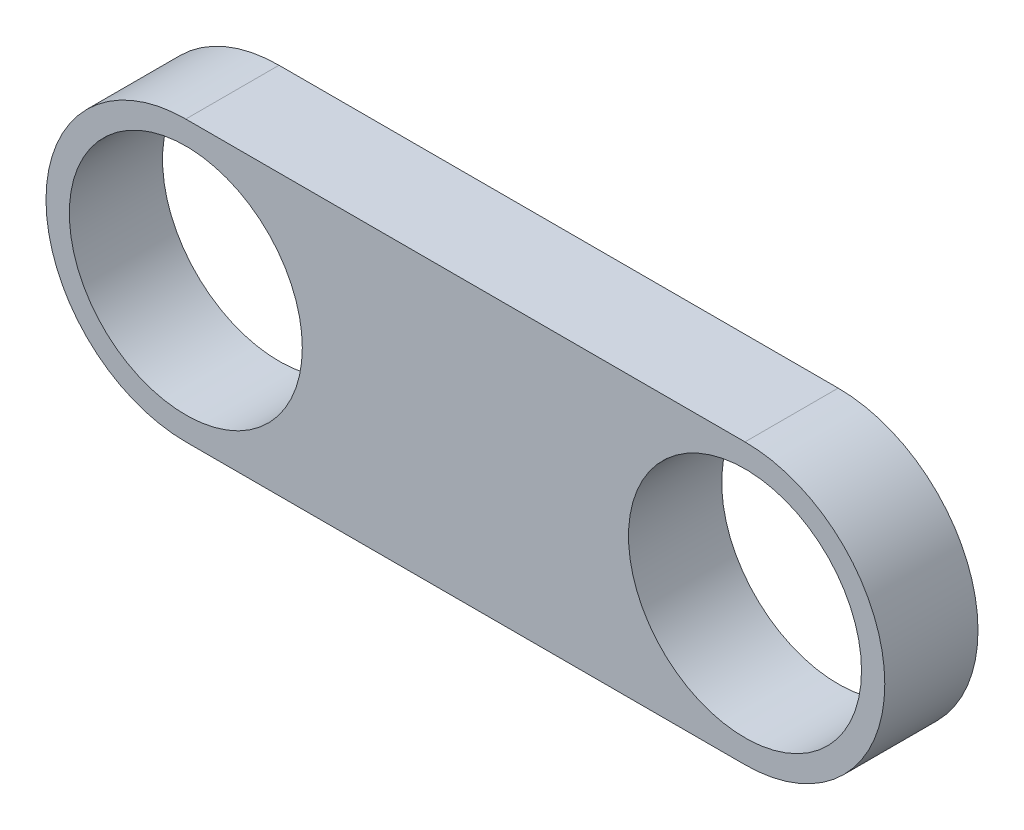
from build123d import *

# Parameters (mm, degrees)
SKETCH1_R           = 12.5
BOSS_EXTRUDE1_DEPTH = 10


with BuildPart() as part:
    # Sketch1 → Boss-Extrude1 (new body)
    with BuildSketch(Plane.XY):
        with BuildLine():
            Line((0, 15), (60, 15))
            ThreePointArc((60, 15), (75, 0), (60, -15))
            Line((60, -15), (0, -15))
            ThreePointArc((0, -15), (-15, 0), (0, 15))
        make_face()
        Circle(SKETCH1_R, mode=Mode.SUBTRACT)
        with Locations((60, 0)):
            Circle(SKETCH1_R, mode=Mode.SUBTRACT)
    extrude(amount=BOSS_EXTRUDE1_DEPTH)


solid = part.part
